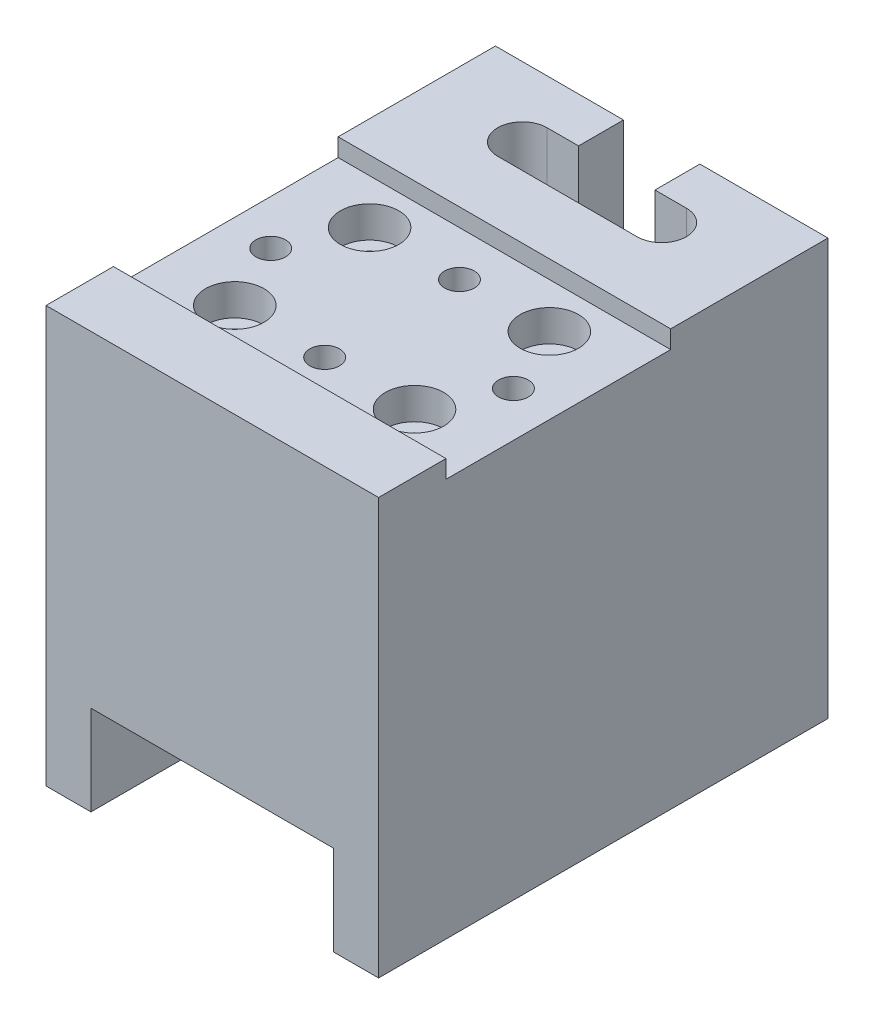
from build123d import *

# Parameters (mm, degrees)
EXTRUDE_1_DEPTH          = 50
CUT_EXTRUDE_1_DEPTH      = 78.541537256
CUT_EXTRUDE_1_DEPTH_BACK = 78.541537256
SKETCH_3_OUTSIDE_W       = 54.508
SKETCH_3_OUTSIDE_H       = 67.508
SKETCH_3_OUTSIDE_R       = 1.75
CUT_EXTRUDE_2_DEPTH      = 50
SKETCH_4_R               = 3.25
CUT_EXTRUDE_3_DEPTH      = 3.5
SKETCH_5_R               = 1.65
CUT_EXTRUDE_4_DEPTH      = 15


with BuildPart() as part:
    # Sketch 1 → Extrude 1 (new body)
    with BuildSketch(Plane.XY):
        Polygon((5, 10), (32, 10), (32, 0), (37, 0), (37, 46.3), (0, 46.3), (0, 0), (5, 0), align=None)
    extrude(amount=EXTRUDE_1_DEPTH)

    # Sketch 2 → Cut-Extrude 1 (cut, two sides: drawn at the far end of the back side and taken through both)
    with BuildSketch(Plane(origin=(37, 0, 0), x_dir=(0, 0, -1), z_dir=(1, 0, 0)).offset(-CUT_EXTRUDE_1_DEPTH_BACK)):
        Polygon((-42.5, 181.997096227), (-42.5, 46.3), (-42.5, 44.3), (-17.5, 44.3), (-17.5, 46.3), (-17.5, 181.997096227), (-17.5, 453.391288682), (-42.5, 453.391288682), align=None)
    extrude(amount=CUT_EXTRUDE_1_DEPTH + CUT_EXTRUDE_1_DEPTH_BACK, mode=Mode.SUBTRACT)

    # Sketch 3 outside → Cut-Extrude 2 (cut)
    # profile 1 of 5: a face of its own
    with BuildSketch(Plane(origin=(0, 46.3, 0), x_dir=(1, 0, 0), z_dir=(0, 1, 0))):
        with Locations((18.5, -25)):
            Rectangle(SKETCH_3_OUTSIDE_W, SKETCH_3_OUTSIDE_H)
        with BuildLine():
            Line((0, -50), (37, -50))
            Line((37, -50), (37, 0))
            Line((37, 0), (22.75, 0))
            Line((22.75, 0), (22.75, -5))
            Line((22.75, -5), (26.25, -5))
            ThreePointArc((26.25, -5), (29, -7.75), (26.25, -10.5))
            Line((26.25, -10.5), (10.75, -10.5))
            ThreePointArc((10.75, -10.5), (8, -7.75), (10.75, -5))
            Line((10.75, -5), (14.25, -5))
            Line((14.25, -5), (14.25, 0))
            Line((14.25, 0), (0, 0))
            Line((0, 0), (0, -50))
        make_face(mode=Mode.SUBTRACT)
    # profile 2 of 5: a face of its own
    with BuildSketch(Plane(origin=(0, 46.3, 0), x_dir=(1, 0, 0), z_dir=(0, 1, 0))):
        with Locations(Location((8.5, -37.5, 0), (0, 0, 270))):
            Circle(SKETCH_3_OUTSIDE_R)
    # profile 3 of 5: a face of its own
    with BuildSketch(Plane(origin=(0, 46.3, 0), x_dir=(1, 0, 0), z_dir=(0, 1, 0))):
        with Locations(Location((28.5, -37.5, 0), (0, 0, 270))):
            Circle(SKETCH_3_OUTSIDE_R)
    # profile 4 of 5: a face of its own
    with BuildSketch(Plane(origin=(0, 46.3, 0), x_dir=(1, 0, 0), z_dir=(0, 1, 0))):
        with Locations(Location((28.5, -22.5, 0), (0, 0, 270))):
            Circle(SKETCH_3_OUTSIDE_R)
    # profile 5 of 5: a face of its own
    with BuildSketch(Plane(origin=(0, 46.3, 0), x_dir=(1, 0, 0), z_dir=(0, 1, 0))):
        with Locations(Location((8.5, -22.5, 0), (0, 0, 270))):
            Circle(SKETCH_3_OUTSIDE_R)
    extrude(amount=-CUT_EXTRUDE_2_DEPTH, mode=Mode.SUBTRACT)

    # Sketch 4 → Cut-Extrude 3 (cut)
    with BuildSketch(Plane(origin=(0, 44.3, 0), x_dir=(1, 0, 0), z_dir=(0, 1, 0))):
        with Locations(Location((8.5, -37.5, 0), (0, 0, 270))):
            Circle(SKETCH_4_R)
        with Locations(Location((28.5, -37.5, 0), (0, 0, 270))):
            Circle(SKETCH_4_R)
        with Locations(Location((28.5, -22.5, 0), (0, 0, 270))):
            Circle(SKETCH_4_R)
        with Locations(Location((8.5, -22.5, 0), (0, 0, 270))):
            Circle(SKETCH_4_R)
    extrude(amount=-CUT_EXTRUDE_3_DEPTH, mode=Mode.SUBTRACT)

    # Sketch 5 → Cut-Extrude 4 (cut)
    with BuildSketch(Plane(origin=(0, 44.3, 0), x_dir=(1, 0, 0), z_dir=(0, 1, 0))):
        with Locations(Location((18.5, -22.5, 0), (0, 0, 270))):
            Circle(SKETCH_5_R)
        with Locations(Location((32, -30, 0), (0, 0, 270))):
            Circle(SKETCH_5_R)
        with Locations(Location((18.5, -37.5, 0), (0, 0, 270))):
            Circle(SKETCH_5_R)
        with Locations(Location((5, -30, 0), (0, 0, 270))):
            Circle(SKETCH_5_R)
    extrude(amount=-CUT_EXTRUDE_4_DEPTH, mode=Mode.SUBTRACT)


solid = part.part
